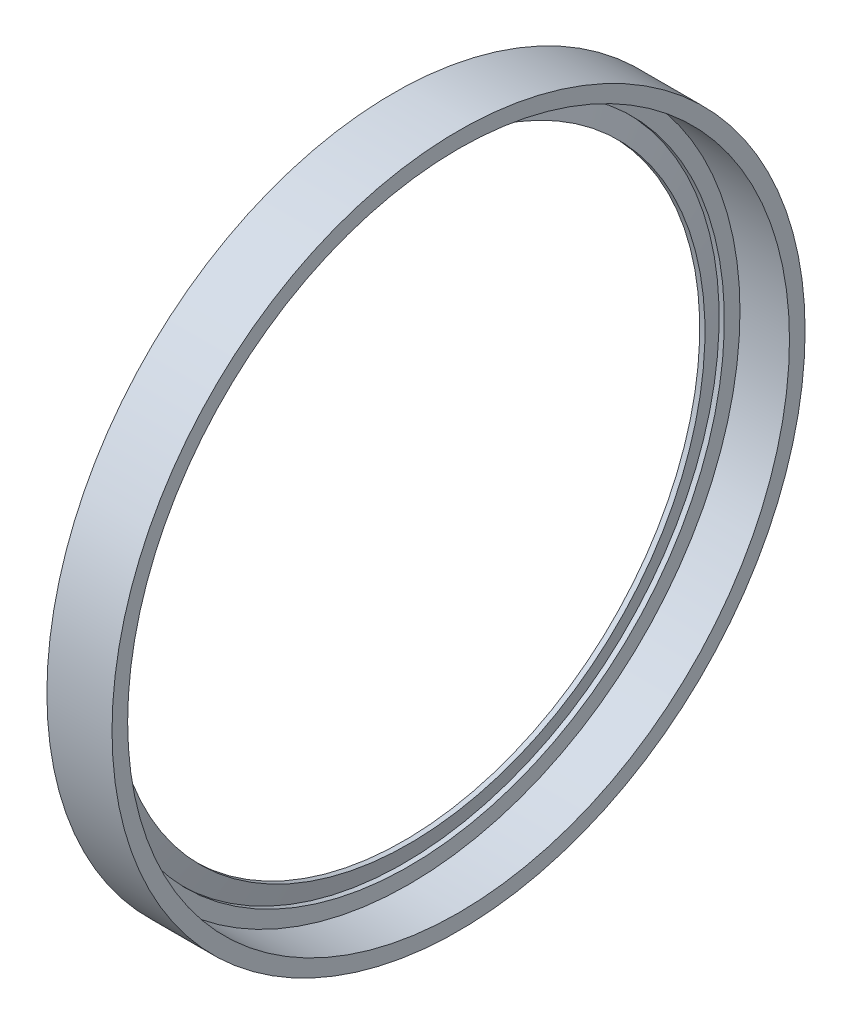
from build123d import *


with BuildPart() as part:
    # Sketch1 → Revolve1 (revolve)
    with BuildSketch(Plane.XY, mode=Mode.PRIVATE) as revolve1_sk:
        Polygon((0, 33.7947), (6.35, 33.7947), (6.35, 32.2707), (1.524, 32.2707), (1.524, 30.7467), (1.016, 30.7467), (1.524, 28.8544), (1.016, 28.8544), (0.508, 30.7467), (0, 30.7467), align=None)
    revolve(revolve1_sk.sketch.rotate(Axis((-57.801798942, 0, 0), (1, 0, 0)), 90), axis=Axis((-57.801798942, 0, 0), (1, 0, 0)))


solid = part.part
